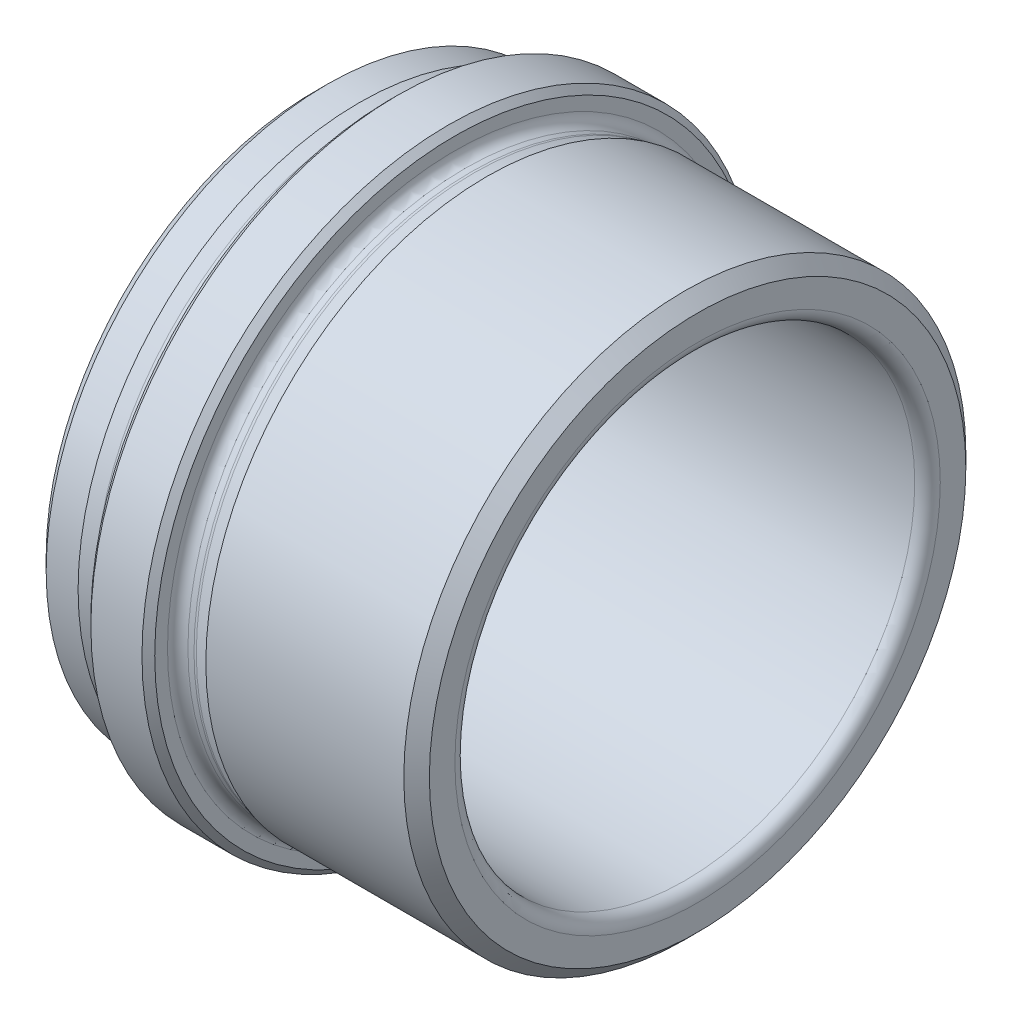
ISO-10303-21;
HEADER;
FILE_DESCRIPTION(('STEP AP214'),'2;1');
FILE_NAME('part.step','',(''),(''),'','','');
FILE_SCHEMA(('AUTOMOTIVE_DESIGN { 1 0 10303 214 1 1 1 1 }'));
ENDSEC;
DATA;
#1=APPLICATION_CONTEXT('core data for automotive mechanical design processes');
#2=APPLICATION_PROTOCOL_DEFINITION('international standard','automotive_design',2000,#1);
#3=PRODUCT_CONTEXT('',#1,'mechanical');
#4=PRODUCT('Part','Part','',(#3));
#5=PRODUCT_RELATED_PRODUCT_CATEGORY('part','',(#4));
#6=PRODUCT_DEFINITION_FORMATION('','',#4);
#7=PRODUCT_DEFINITION_CONTEXT('part definition',#1,'design');
#8=PRODUCT_DEFINITION('design','',#6,#7);
#9=PRODUCT_DEFINITION_SHAPE('','',#8);
#10=(LENGTH_UNIT() NAMED_UNIT(*) SI_UNIT(.MILLI.,.METRE.));
#11=(NAMED_UNIT(*) PLANE_ANGLE_UNIT() SI_UNIT($,.RADIAN.));
#12=(NAMED_UNIT(*) SI_UNIT($,.STERADIAN.) SOLID_ANGLE_UNIT());
#13=UNCERTAINTY_MEASURE_WITH_UNIT(LENGTH_MEASURE(1.E-05),#10,'distance_accuracy_value','');
#14=(GEOMETRIC_REPRESENTATION_CONTEXT(3) GLOBAL_UNCERTAINTY_ASSIGNED_CONTEXT((#13)) GLOBAL_UNIT_ASSIGNED_CONTEXT((#10,
#11,#12)) REPRESENTATION_CONTEXT('',''));
#15=CARTESIAN_POINT('',(0.,0.,0.));
#16=DIRECTION('',(0.,0.,1.));
#17=DIRECTION('',(1.,0.,0.));
#18=AXIS2_PLACEMENT_3D('',#15,#16,#17);
#19=CARTESIAN_POINT('',(5.2,0.,0.));
#20=DIRECTION('',(-1.,0.,0.));
#21=DIRECTION('',(0.,0.,1.));
#22=AXIS2_PLACEMENT_3D('',#19,#20,#21);
#23=TOROIDAL_SURFACE('',#22,22.5,0.8);
#24=CARTESIAN_POINT('',(5.2,0.,0.));
#25=DIRECTION('',(-1.,0.,0.));
#26=DIRECTION('',(0.,0.,1.));
#27=AXIS2_PLACEMENT_3D('',#24,#25,#26);
#28=CIRCLE('',#27,21.7);
#29=CARTESIAN_POINT('',(5.2,0.,21.7));
#30=VERTEX_POINT('',#29);
#31=EDGE_CURVE('E58',#30,#30,#28,.T.);
#32=ORIENTED_EDGE('',*,*,#31,.F.);
#33=EDGE_LOOP('',(#32));
#34=FACE_BOUND('',#33,.T.);
#35=CARTESIAN_POINT('',(6.,0.,0.));
#36=DIRECTION('',(-1.,0.,0.));
#37=DIRECTION('',(0.,0.,1.));
#38=AXIS2_PLACEMENT_3D('',#35,#36,#37);
#39=CIRCLE('',#38,22.5);
#40=CARTESIAN_POINT('',(6.,0.,22.5));
#41=VERTEX_POINT('',#40);
#42=EDGE_CURVE('E85',#41,#41,#39,.T.);
#43=ORIENTED_EDGE('',*,*,#42,.T.);
#44=EDGE_LOOP('',(#43));
#45=FACE_BOUND('',#44,.T.);
#46=ADVANCED_FACE('F14',(#34,#45),#23,.F.);
#47=CARTESIAN_POINT('',(0.,0.,0.));
#48=DIRECTION('',(-1.,0.,0.));
#49=DIRECTION('',(0.,0.,1.));
#50=AXIS2_PLACEMENT_3D('',#47,#48,#49);
#51=CYLINDRICAL_SURFACE('',#50,21.7);
#52=CARTESIAN_POINT('',(4.72493724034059,0.,0.));
#53=DIRECTION('',(-1.,0.,0.));
#54=DIRECTION('',(0.,0.,1.));
#55=AXIS2_PLACEMENT_3D('',#52,#53,#54);
#56=CIRCLE('',#55,21.7);
#57=CARTESIAN_POINT('',(4.72493724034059,0.,21.7));
#58=VERTEX_POINT('',#57);
#59=EDGE_CURVE('E61',#58,#58,#56,.T.);
#60=ORIENTED_EDGE('',*,*,#59,.F.);
#61=EDGE_LOOP('',(#60));
#62=FACE_BOUND('',#61,.T.);
#63=ORIENTED_EDGE('',*,*,#31,.T.);
#64=EDGE_LOOP('',(#63));
#65=FACE_BOUND('',#64,.T.);
#66=ADVANCED_FACE('F109',(#62,#65),#51,.T.);
#67=CARTESIAN_POINT('',(4.72493724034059,0.,0.));
#68=DIRECTION('',(-1.,0.,0.));
#69=DIRECTION('',(0.,0.,1.));
#70=AXIS2_PLACEMENT_3D('',#67,#68,#69);
#71=TOROIDAL_SURFACE('',#70,22.5,0.8);
#72=CARTESIAN_POINT('',(4.51788200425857,0.,0.));
#73=DIRECTION('',(-1.,0.,0.));
#74=DIRECTION('',(0.,0.,1.));
#75=AXIS2_PLACEMENT_3D('',#72,#73,#74);
#76=CIRCLE('',#75,21.7272593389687);
#77=CARTESIAN_POINT('',(4.51788200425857,0.,21.7272593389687));
#78=VERTEX_POINT('',#77);
#79=EDGE_CURVE('E64',#78,#78,#76,.T.);
#80=ORIENTED_EDGE('',*,*,#79,.F.);
#81=EDGE_LOOP('',(#80));
#82=FACE_BOUND('',#81,.T.);
#83=ORIENTED_EDGE('',*,*,#59,.T.);
#84=EDGE_LOOP('',(#83));
#85=FACE_BOUND('',#84,.T.);
#86=ADVANCED_FACE('F116',(#82,#85),#71,.F.);
#87=CARTESIAN_POINT('',(4.51788200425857,0.,0.));
#88=DIRECTION('',(-1.,0.,0.));
#89=DIRECTION('',(0.,0.,1.));
#90=AXIS2_PLACEMENT_3D('',#87,#88,#89);
#91=CONICAL_SURFACE('',#90,21.7272593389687,0.26179938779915);
#92=CARTESIAN_POINT('',(3.5,0.,0.));
#93=DIRECTION('',(-1.,0.,0.));
#94=DIRECTION('',(0.,0.,1.));
#95=AXIS2_PLACEMENT_3D('',#92,#93,#94);
#96=CIRCLE('',#95,22.);
#97=CARTESIAN_POINT('',(3.5,0.,22.));
#98=VERTEX_POINT('',#97);
#99=EDGE_CURVE('E67',#98,#98,#96,.T.);
#100=ORIENTED_EDGE('',*,*,#99,.F.);
#101=EDGE_LOOP('',(#100));
#102=FACE_BOUND('',#101,.T.);
#103=ORIENTED_EDGE('',*,*,#79,.T.);
#104=EDGE_LOOP('',(#103));
#105=FACE_BOUND('',#104,.T.);
#106=ADVANCED_FACE('F164',(#102,#105),#91,.T.);
#107=CARTESIAN_POINT('',(0.,0.,0.));
#108=DIRECTION('',(-1.,0.,0.));
#109=DIRECTION('',(0.,0.,1.));
#110=AXIS2_PLACEMENT_3D('',#107,#108,#109);
#111=CYLINDRICAL_SURFACE('',#110,22.);
#112=CARTESIAN_POINT('',(1.00000000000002,0.,0.));
#113=DIRECTION('',(1.,0.,0.));
#114=DIRECTION('',(0.,0.,-1.));
#115=AXIS2_PLACEMENT_3D('',#112,#113,#114);
#116=CIRCLE('',#115,22.);
#117=CARTESIAN_POINT('',(1.00000000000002,0.,-22.));
#118=VERTEX_POINT('',#117);
#119=EDGE_CURVE('E46',#118,#118,#116,.T.);
#120=ORIENTED_EDGE('',*,*,#119,.T.);
#121=EDGE_LOOP('',(#120));
#122=FACE_BOUND('',#121,.T.);
#123=ORIENTED_EDGE('',*,*,#99,.T.);
#124=EDGE_LOOP('',(#123));
#125=FACE_BOUND('',#124,.T.);
#126=ADVANCED_FACE('F158',(#122,#125),#111,.T.);
#127=CARTESIAN_POINT('',(0.,18.,0.));
#128=DIRECTION('',(1.,0.,0.));
#129=DIRECTION('',(0.,0.,-1.));
#130=AXIS2_PLACEMENT_3D('',#127,#128,#129);
#131=PLANE('',#130);
#132=CARTESIAN_POINT('',(0.,0.,0.));
#133=DIRECTION('',(1.,0.,0.));
#134=DIRECTION('',(0.,0.,-1.));
#135=AXIS2_PLACEMENT_3D('',#132,#133,#134);
#136=CIRCLE('',#135,19.);
#137=CARTESIAN_POINT('',(0.,0.,-19.));
#138=VERTEX_POINT('',#137);
#139=EDGE_CURVE('E21',#138,#138,#136,.T.);
#140=ORIENTED_EDGE('',*,*,#139,.T.);
#141=EDGE_LOOP('',(#140));
#142=FACE_BOUND('',#141,.T.);
#143=CARTESIAN_POINT('',(0.,0.,0.));
#144=DIRECTION('',(1.,0.,0.));
#145=DIRECTION('',(0.,0.,-1.));
#146=AXIS2_PLACEMENT_3D('',#143,#144,#145);
#147=CIRCLE('',#146,21.);
#148=CARTESIAN_POINT('',(0.,0.,-21.));
#149=VERTEX_POINT('',#148);
#150=EDGE_CURVE('E49',#149,#149,#147,.F.);
#151=ORIENTED_EDGE('',*,*,#150,.T.);
#152=EDGE_LOOP('',(#151));
#153=FACE_BOUND('',#152,.T.);
#154=ADVANCED_FACE('F147',(#142,#153),#131,.F.);
#155=CARTESIAN_POINT('',(0.,0.,0.));
#156=DIRECTION('',(-1.,0.,0.));
#157=DIRECTION('',(0.,0.,1.));
#158=AXIS2_PLACEMENT_3D('',#155,#156,#157);
#159=CYLINDRICAL_SURFACE('',#158,18.);
#160=CARTESIAN_POINT('',(1.,0.,0.));
#161=DIRECTION('',(1.,0.,0.));
#162=DIRECTION('',(0.,0.,-1.));
#163=AXIS2_PLACEMENT_3D('',#160,#161,#162);
#164=CIRCLE('',#163,18.);
#165=CARTESIAN_POINT('',(1.,0.,-18.));
#166=VERTEX_POINT('',#165);
#167=EDGE_CURVE('E25',#166,#166,#164,.F.);
#168=ORIENTED_EDGE('',*,*,#167,.T.);
#169=EDGE_LOOP('',(#168));
#170=FACE_BOUND('',#169,.T.);
#171=CARTESIAN_POINT('',(29.,0.,0.));
#172=DIRECTION('',(-1.,0.,0.));
#173=DIRECTION('',(0.,0.,1.));
#174=AXIS2_PLACEMENT_3D('',#171,#172,#173);
#175=CIRCLE('',#174,18.);
#176=CARTESIAN_POINT('',(29.,0.,18.));
#177=VERTEX_POINT('',#176);
#178=EDGE_CURVE('E29',#177,#177,#175,.F.);
#179=ORIENTED_EDGE('',*,*,#178,.T.);
#180=EDGE_LOOP('',(#179));
#181=FACE_BOUND('',#180,.T.);
#182=ADVANCED_FACE('F143',(#170,#181),#159,.F.);
#183=CARTESIAN_POINT('',(30.,22.,0.));
#184=DIRECTION('',(-1.,0.,0.));
#185=DIRECTION('',(0.,0.,1.));
#186=AXIS2_PLACEMENT_3D('',#183,#184,#185);
#187=PLANE('',#186);
#188=CARTESIAN_POINT('',(30.,0.,0.));
#189=DIRECTION('',(-1.,0.,0.));
#190=DIRECTION('',(0.,0.,1.));
#191=AXIS2_PLACEMENT_3D('',#188,#189,#190);
#192=CIRCLE('',#191,19.);
#193=CARTESIAN_POINT('',(30.,0.,19.));
#194=VERTEX_POINT('',#193);
#195=EDGE_CURVE('E9',#194,#194,#192,.T.);
#196=ORIENTED_EDGE('',*,*,#195,.T.);
#197=EDGE_LOOP('',(#196));
#198=FACE_BOUND('',#197,.T.);
#199=CARTESIAN_POINT('',(30.,0.,0.));
#200=DIRECTION('',(-1.,0.,0.));
#201=DIRECTION('',(0.,0.,1.));
#202=AXIS2_PLACEMENT_3D('',#199,#200,#201);
#203=CIRCLE('',#202,21.);
#204=CARTESIAN_POINT('',(30.,0.,21.));
#205=VERTEX_POINT('',#204);
#206=EDGE_CURVE('E52',#205,#205,#203,.F.);
#207=ORIENTED_EDGE('',*,*,#206,.T.);
#208=EDGE_LOOP('',(#207));
#209=FACE_BOUND('',#208,.T.);
#210=ADVANCED_FACE('F146',(#198,#209),#187,.F.);
#211=CARTESIAN_POINT('',(0.,0.,0.));
#212=DIRECTION('',(-1.,0.,0.));
#213=DIRECTION('',(0.,0.,1.));
#214=AXIS2_PLACEMENT_3D('',#211,#212,#213);
#215=CYLINDRICAL_SURFACE('',#214,22.);
#216=CARTESIAN_POINT('',(29.,0.,0.));
#217=DIRECTION('',(-1.,0.,0.));
#218=DIRECTION('',(0.,0.,1.));
#219=AXIS2_PLACEMENT_3D('',#216,#217,#218);
#220=CIRCLE('',#219,22.);
#221=CARTESIAN_POINT('',(29.,0.,22.));
#222=VERTEX_POINT('',#221);
#223=EDGE_CURVE('E55',#222,#222,#220,.T.);
#224=ORIENTED_EDGE('',*,*,#223,.T.);
#225=EDGE_LOOP('',(#224));
#226=FACE_BOUND('',#225,.T.);
#227=CARTESIAN_POINT('',(13.5,0.,0.));
#228=DIRECTION('',(-1.,0.,0.));
#229=DIRECTION('',(0.,0.,1.));
#230=AXIS2_PLACEMENT_3D('',#227,#228,#229);
#231=CIRCLE('',#230,22.);
#232=CARTESIAN_POINT('',(13.5,0.,22.));
#233=VERTEX_POINT('',#232);
#234=EDGE_CURVE('E70',#233,#233,#231,.T.);
#235=ORIENTED_EDGE('',*,*,#234,.F.);
#236=EDGE_LOOP('',(#235));
#237=FACE_BOUND('',#236,.T.);
#238=ADVANCED_FACE('F156',(#226,#237),#215,.T.);
#239=CARTESIAN_POINT('',(13.5,0.,0.));
#240=DIRECTION('',(1.,0.,0.));
#241=DIRECTION('',(0.,0.,-1.));
#242=AXIS2_PLACEMENT_3D('',#239,#240,#241);
#243=CONICAL_SURFACE('',#242,22.,0.26179938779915);
#244=CARTESIAN_POINT('',(12.4821179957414,0.,0.));
#245=DIRECTION('',(-1.,0.,0.));
#246=DIRECTION('',(0.,0.,1.));
#247=AXIS2_PLACEMENT_3D('',#244,#245,#246);
#248=CIRCLE('',#247,21.7272593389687);
#249=CARTESIAN_POINT('',(12.4821179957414,0.,21.7272593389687));
#250=VERTEX_POINT('',#249);
#251=EDGE_CURVE('E73',#250,#250,#248,.T.);
#252=ORIENTED_EDGE('',*,*,#251,.F.);
#253=EDGE_LOOP('',(#252));
#254=FACE_BOUND('',#253,.T.);
#255=ORIENTED_EDGE('',*,*,#234,.T.);
#256=EDGE_LOOP('',(#255));
#257=FACE_BOUND('',#256,.T.);
#258=ADVANCED_FACE('F297',(#254,#257),#243,.T.);
#259=CARTESIAN_POINT('',(12.2750627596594,0.,0.));
#260=DIRECTION('',(-1.,0.,0.));
#261=DIRECTION('',(0.,0.,1.));
#262=AXIS2_PLACEMENT_3D('',#259,#260,#261);
#263=TOROIDAL_SURFACE('',#262,22.5,0.8);
#264=CARTESIAN_POINT('',(12.2750627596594,0.,0.));
#265=DIRECTION('',(-1.,0.,0.));
#266=DIRECTION('',(0.,0.,1.));
#267=AXIS2_PLACEMENT_3D('',#264,#265,#266);
#268=CIRCLE('',#267,21.7);
#269=CARTESIAN_POINT('',(12.2750627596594,0.,21.7));
#270=VERTEX_POINT('',#269);
#271=EDGE_CURVE('E76',#270,#270,#268,.T.);
#272=ORIENTED_EDGE('',*,*,#271,.F.);
#273=EDGE_LOOP('',(#272));
#274=FACE_BOUND('',#273,.T.);
#275=ORIENTED_EDGE('',*,*,#251,.T.);
#276=EDGE_LOOP('',(#275));
#277=FACE_BOUND('',#276,.T.);
#278=ADVANCED_FACE('F288',(#274,#277),#263,.F.);
#279=CARTESIAN_POINT('',(0.,0.,0.));
#280=DIRECTION('',(-1.,0.,0.));
#281=DIRECTION('',(0.,0.,1.));
#282=AXIS2_PLACEMENT_3D('',#279,#280,#281);
#283=CYLINDRICAL_SURFACE('',#282,21.7);
#284=CARTESIAN_POINT('',(11.8,0.,0.));
#285=DIRECTION('',(-1.,0.,0.));
#286=DIRECTION('',(0.,0.,1.));
#287=AXIS2_PLACEMENT_3D('',#284,#285,#286);
#288=CIRCLE('',#287,21.7);
#289=CARTESIAN_POINT('',(11.8,0.,21.7));
#290=VERTEX_POINT('',#289);
#291=EDGE_CURVE('E79',#290,#290,#288,.T.);
#292=ORIENTED_EDGE('',*,*,#291,.F.);
#293=EDGE_LOOP('',(#292));
#294=FACE_BOUND('',#293,.T.);
#295=ORIENTED_EDGE('',*,*,#271,.T.);
#296=EDGE_LOOP('',(#295));
#297=FACE_BOUND('',#296,.T.);
#298=ADVANCED_FACE('F279',(#294,#297),#283,.T.);
#299=CARTESIAN_POINT('',(11.8,0.,0.));
#300=DIRECTION('',(-1.,0.,0.));
#301=DIRECTION('',(0.,0.,1.));
#302=AXIS2_PLACEMENT_3D('',#299,#300,#301);
#303=TOROIDAL_SURFACE('',#302,22.5,0.8);
#304=CARTESIAN_POINT('',(11.,0.,0.));
#305=DIRECTION('',(-1.,0.,0.));
#306=DIRECTION('',(0.,0.,1.));
#307=AXIS2_PLACEMENT_3D('',#304,#305,#306);
#308=CIRCLE('',#307,22.5);
#309=CARTESIAN_POINT('',(11.,0.,22.5));
#310=VERTEX_POINT('',#309);
#311=EDGE_CURVE('E82',#310,#310,#308,.T.);
#312=ORIENTED_EDGE('',*,*,#311,.F.);
#313=EDGE_LOOP('',(#312));
#314=FACE_BOUND('',#313,.T.);
#315=ORIENTED_EDGE('',*,*,#291,.T.);
#316=EDGE_LOOP('',(#315));
#317=FACE_BOUND('',#316,.T.);
#318=ADVANCED_FACE('F271',(#314,#317),#303,.F.);
#319=CARTESIAN_POINT('',(11.,22.5,0.));
#320=DIRECTION('',(-1.,0.,0.));
#321=DIRECTION('',(0.,0.,1.));
#322=AXIS2_PLACEMENT_3D('',#319,#320,#321);
#323=PLANE('',#322);
#324=CARTESIAN_POINT('',(11.,0.,0.));
#325=DIRECTION('',(-1.,0.,0.));
#326=DIRECTION('',(0.,0.,1.));
#327=AXIS2_PLACEMENT_3D('',#324,#325,#326);
#328=CIRCLE('',#327,23.5);
#329=CARTESIAN_POINT('',(11.,0.,23.5));
#330=VERTEX_POINT('',#329);
#331=EDGE_CURVE('E37',#330,#330,#328,.F.);
#332=ORIENTED_EDGE('',*,*,#331,.T.);
#333=EDGE_LOOP('',(#332));
#334=FACE_BOUND('',#333,.T.);
#335=ORIENTED_EDGE('',*,*,#311,.T.);
#336=EDGE_LOOP('',(#335));
#337=FACE_BOUND('',#336,.T.);
#338=ADVANCED_FACE('F105',(#334,#337),#323,.F.);
#339=CARTESIAN_POINT('',(0.,0.,0.));
#340=DIRECTION('',(-1.,0.,0.));
#341=DIRECTION('',(0.,0.,1.));
#342=AXIS2_PLACEMENT_3D('',#339,#340,#341);
#343=CYLINDRICAL_SURFACE('',#342,24.);
#344=CARTESIAN_POINT('',(10.5,0.,0.));
#345=DIRECTION('',(-1.,0.,0.));
#346=DIRECTION('',(0.,0.,1.));
#347=AXIS2_PLACEMENT_3D('',#344,#345,#346);
#348=CIRCLE('',#347,24.);
#349=CARTESIAN_POINT('',(10.5,0.,24.));
#350=VERTEX_POINT('',#349);
#351=EDGE_CURVE('E40',#350,#350,#348,.T.);
#352=ORIENTED_EDGE('',*,*,#351,.T.);
#353=EDGE_LOOP('',(#352));
#354=FACE_BOUND('',#353,.T.);
#355=CARTESIAN_POINT('',(6.5,0.,0.));
#356=DIRECTION('',(1.,0.,0.));
#357=DIRECTION('',(0.,0.,-1.));
#358=AXIS2_PLACEMENT_3D('',#355,#356,#357);
#359=CIRCLE('',#358,24.);
#360=CARTESIAN_POINT('',(6.5,0.,-24.));
#361=VERTEX_POINT('',#360);
#362=EDGE_CURVE('E43',#361,#361,#359,.T.);
#363=ORIENTED_EDGE('',*,*,#362,.T.);
#364=EDGE_LOOP('',(#363));
#365=FACE_BOUND('',#364,.T.);
#366=ADVANCED_FACE('F93',(#354,#365),#343,.T.);
#367=CARTESIAN_POINT('',(6.,22.5,0.));
#368=DIRECTION('',(1.,0.,0.));
#369=DIRECTION('',(0.,0.,-1.));
#370=AXIS2_PLACEMENT_3D('',#367,#368,#369);
#371=PLANE('',#370);
#372=CARTESIAN_POINT('',(6.,0.,0.));
#373=DIRECTION('',(1.,0.,0.));
#374=DIRECTION('',(0.,0.,-1.));
#375=AXIS2_PLACEMENT_3D('',#372,#373,#374);
#376=CIRCLE('',#375,23.5);
#377=CARTESIAN_POINT('',(6.,0.,-23.5));
#378=VERTEX_POINT('',#377);
#379=EDGE_CURVE('E34',#378,#378,#376,.F.);
#380=ORIENTED_EDGE('',*,*,#379,.T.);
#381=EDGE_LOOP('',(#380));
#382=FACE_BOUND('',#381,.T.);
#383=ORIENTED_EDGE('',*,*,#42,.F.);
#384=EDGE_LOOP('',(#383));
#385=FACE_BOUND('',#384,.T.);
#386=ADVANCED_FACE('F90',(#382,#385),#371,.F.);
#387=CARTESIAN_POINT('',(29.,0.,0.));
#388=DIRECTION('',(-1.,0.,0.));
#389=DIRECTION('',(0.,0.,1.));
#390=AXIS2_PLACEMENT_3D('',#387,#388,#389);
#391=CONICAL_SURFACE('',#390,22.,0.785398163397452);
#392=ORIENTED_EDGE('',*,*,#206,.F.);
#393=EDGE_LOOP('',(#392));
#394=FACE_BOUND('',#393,.T.);
#395=ORIENTED_EDGE('',*,*,#223,.F.);
#396=EDGE_LOOP('',(#395));
#397=FACE_BOUND('',#396,.T.);
#398=ADVANCED_FACE('F92',(#394,#397),#391,.T.);
#399=CARTESIAN_POINT('',(0.,0.,0.));
#400=DIRECTION('',(1.,0.,0.));
#401=DIRECTION('',(0.,0.,-1.));
#402=AXIS2_PLACEMENT_3D('',#399,#400,#401);
#403=CONICAL_SURFACE('',#402,21.,0.785398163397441);
#404=ORIENTED_EDGE('',*,*,#119,.F.);
#405=EDGE_LOOP('',(#404));
#406=FACE_BOUND('',#405,.T.);
#407=ORIENTED_EDGE('',*,*,#150,.F.);
#408=EDGE_LOOP('',(#407));
#409=FACE_BOUND('',#408,.T.);
#410=ADVANCED_FACE('F102',(#406,#409),#403,.T.);
#411=CARTESIAN_POINT('',(10.5,0.,0.));
#412=DIRECTION('',(-1.,0.,0.));
#413=DIRECTION('',(0.,0.,1.));
#414=AXIS2_PLACEMENT_3D('',#411,#412,#413);
#415=CONICAL_SURFACE('',#414,24.,0.785398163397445);
#416=ORIENTED_EDGE('',*,*,#331,.F.);
#417=EDGE_LOOP('',(#416));
#418=FACE_BOUND('',#417,.T.);
#419=ORIENTED_EDGE('',*,*,#351,.F.);
#420=EDGE_LOOP('',(#419));
#421=FACE_BOUND('',#420,.T.);
#422=ADVANCED_FACE('F124',(#418,#421),#415,.T.);
#423=CARTESIAN_POINT('',(6.,0.,0.));
#424=DIRECTION('',(1.,0.,0.));
#425=DIRECTION('',(0.,0.,-1.));
#426=AXIS2_PLACEMENT_3D('',#423,#424,#425);
#427=CONICAL_SURFACE('',#426,23.5,0.785398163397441);
#428=ORIENTED_EDGE('',*,*,#362,.F.);
#429=EDGE_LOOP('',(#428));
#430=FACE_BOUND('',#429,.T.);
#431=ORIENTED_EDGE('',*,*,#379,.F.);
#432=EDGE_LOOP('',(#431));
#433=FACE_BOUND('',#432,.T.);
#434=ADVANCED_FACE('F128',(#430,#433),#427,.T.);
#435=CARTESIAN_POINT('',(1.,0.,0.));
#436=DIRECTION('',(1.,0.,0.));
#437=DIRECTION('',(0.,0.,-1.));
#438=AXIS2_PLACEMENT_3D('',#435,#436,#437);
#439=TOROIDAL_SURFACE('',#438,19.,1.);
#440=ORIENTED_EDGE('',*,*,#139,.F.);
#441=EDGE_LOOP('',(#440));
#442=FACE_BOUND('',#441,.T.);
#443=ORIENTED_EDGE('',*,*,#167,.F.);
#444=EDGE_LOOP('',(#443));
#445=FACE_BOUND('',#444,.T.);
#446=ADVANCED_FACE('F131',(#442,#445),#439,.T.);
#447=CARTESIAN_POINT('',(29.,0.,0.));
#448=DIRECTION('',(-1.,0.,0.));
#449=DIRECTION('',(0.,0.,1.));
#450=AXIS2_PLACEMENT_3D('',#447,#448,#449);
#451=TOROIDAL_SURFACE('',#450,19.,1.);
#452=ORIENTED_EDGE('',*,*,#178,.F.);
#453=EDGE_LOOP('',(#452));
#454=FACE_BOUND('',#453,.T.);
#455=ORIENTED_EDGE('',*,*,#195,.F.);
#456=EDGE_LOOP('',(#455));
#457=FACE_BOUND('',#456,.T.);
#458=ADVANCED_FACE('F16',(#454,#457),#451,.T.);
#459=CLOSED_SHELL('',(#46,#66,#86,#106,#126,#154,#182,#210,#238,#258,#278,#298,#318,#338,#366,
#386,#398,#410,#422,#434,#446,#458));
#460=MANIFOLD_SOLID_BREP('B1',#459);
#461=ADVANCED_BREP_SHAPE_REPRESENTATION('',(#18,#460),#14);
#462=SHAPE_DEFINITION_REPRESENTATION(#9,#461);
ENDSEC;
END-ISO-10303-21;
